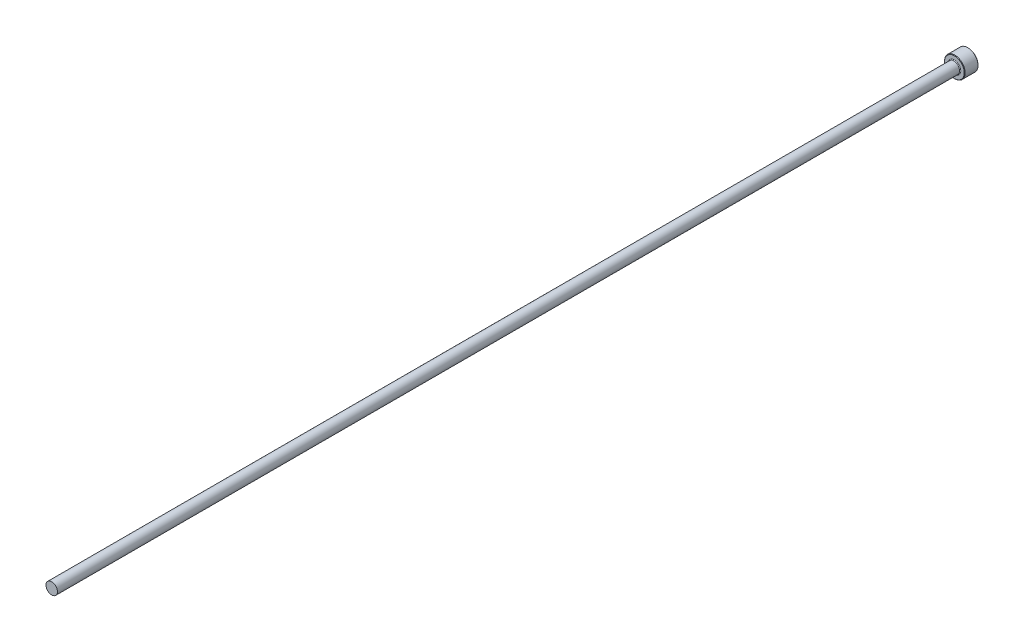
ISO-10303-21;
HEADER;
FILE_DESCRIPTION(('STEP AP214'),'2;1');
FILE_NAME('part.step','',(''),(''),'','','');
FILE_SCHEMA(('AUTOMOTIVE_DESIGN { 1 0 10303 214 1 1 1 1 }'));
ENDSEC;
DATA;
#1=APPLICATION_CONTEXT('core data for automotive mechanical design processes');
#2=APPLICATION_PROTOCOL_DEFINITION('international standard','automotive_design',2000,#1);
#3=PRODUCT_CONTEXT('',#1,'mechanical');
#4=PRODUCT('Part','Part','',(#3));
#5=PRODUCT_RELATED_PRODUCT_CATEGORY('part','',(#4));
#6=PRODUCT_DEFINITION_FORMATION('','',#4);
#7=PRODUCT_DEFINITION_CONTEXT('part definition',#1,'design');
#8=PRODUCT_DEFINITION('design','',#6,#7);
#9=PRODUCT_DEFINITION_SHAPE('','',#8);
#10=(LENGTH_UNIT() NAMED_UNIT(*) SI_UNIT(.MILLI.,.METRE.));
#11=(NAMED_UNIT(*) PLANE_ANGLE_UNIT() SI_UNIT($,.RADIAN.));
#12=(NAMED_UNIT(*) SI_UNIT($,.STERADIAN.) SOLID_ANGLE_UNIT());
#13=UNCERTAINTY_MEASURE_WITH_UNIT(LENGTH_MEASURE(1.E-05),#10,'distance_accuracy_value','');
#14=(GEOMETRIC_REPRESENTATION_CONTEXT(3) GLOBAL_UNCERTAINTY_ASSIGNED_CONTEXT((#13)) GLOBAL_UNIT_ASSIGNED_CONTEXT((#10,
#11,#12)) REPRESENTATION_CONTEXT('',''));
#15=CARTESIAN_POINT('',(0.,0.,0.));
#16=DIRECTION('',(0.,0.,1.));
#17=DIRECTION('',(1.,0.,0.));
#18=AXIS2_PLACEMENT_3D('',#15,#16,#17);
#19=CARTESIAN_POINT('',(0.,2.49999999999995,400.));
#20=DIRECTION('',(0.,0.,-1.));
#21=DIRECTION('',(-1.,0.,0.));
#22=AXIS2_PLACEMENT_3D('',#19,#20,#21);
#23=PLANE('',#22);
#24=CARTESIAN_POINT('',(0.,0.,400.));
#25=DIRECTION('',(0.,0.,1.));
#26=DIRECTION('',(1.,0.,0.));
#27=AXIS2_PLACEMENT_3D('',#24,#25,#26);
#28=CIRCLE('',#27,2.49999999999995);
#29=CARTESIAN_POINT('',(2.49999999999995,0.,400.));
#30=VERTEX_POINT('',#29);
#31=EDGE_CURVE('E50',#30,#30,#28,.T.);
#32=ORIENTED_EDGE('',*,*,#31,.T.);
#33=EDGE_LOOP('',(#32));
#34=FACE_BOUND('',#33,.T.);
#35=ADVANCED_FACE('F30',(#34),#23,.F.);
#36=CARTESIAN_POINT('',(0.,0.,109.050628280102));
#37=DIRECTION('',(0.,0.,1.));
#38=DIRECTION('',(1.,0.,0.));
#39=AXIS2_PLACEMENT_3D('',#36,#37,#38);
#40=CYLINDRICAL_SURFACE('',#39,2.49999999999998);
#41=ORIENTED_EDGE('',*,*,#31,.F.);
#42=EDGE_LOOP('',(#41));
#43=FACE_BOUND('',#42,.T.);
#44=CARTESIAN_POINT('',(0.,0.,6.3));
#45=DIRECTION('',(0.,0.,1.));
#46=DIRECTION('',(1.,0.,0.));
#47=AXIS2_PLACEMENT_3D('',#44,#45,#46);
#48=CIRCLE('',#47,2.5);
#49=CARTESIAN_POINT('',(2.5,0.,6.3));
#50=VERTEX_POINT('',#49);
#51=EDGE_CURVE('E53',#50,#50,#48,.T.);
#52=ORIENTED_EDGE('',*,*,#51,.T.);
#53=EDGE_LOOP('',(#52));
#54=FACE_BOUND('',#53,.T.);
#55=ADVANCED_FACE('F73',(#43,#54),#40,.T.);
#56=CARTESIAN_POINT('',(0.,0.,6.3));
#57=DIRECTION('',(0.,0.,1.));
#58=DIRECTION('',(1.,0.,0.));
#59=AXIS2_PLACEMENT_3D('',#56,#57,#58);
#60=TOROIDAL_SURFACE('',#59,2.8,0.3);
#61=ORIENTED_EDGE('',*,*,#51,.F.);
#62=EDGE_LOOP('',(#61));
#63=FACE_BOUND('',#62,.T.);
#64=CARTESIAN_POINT('',(0.,0.,6.00000000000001));
#65=DIRECTION('',(0.,0.,1.));
#66=DIRECTION('',(1.,0.,0.));
#67=AXIS2_PLACEMENT_3D('',#64,#65,#66);
#68=CIRCLE('',#67,2.8);
#69=CARTESIAN_POINT('',(2.8,0.,6.00000000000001));
#70=VERTEX_POINT('',#69);
#71=EDGE_CURVE('E56',#70,#70,#68,.T.);
#72=ORIENTED_EDGE('',*,*,#71,.T.);
#73=EDGE_LOOP('',(#72));
#74=FACE_BOUND('',#73,.T.);
#75=ADVANCED_FACE('F60',(#63,#74),#60,.F.);
#76=CARTESIAN_POINT('',(0.,4.5,6.));
#77=DIRECTION('',(0.,0.,-1.));
#78=DIRECTION('',(-1.,0.,0.));
#79=AXIS2_PLACEMENT_3D('',#76,#77,#78);
#80=PLANE('',#79);
#81=CARTESIAN_POINT('',(0.,0.,6.));
#82=DIRECTION('',(0.,0.,-1.));
#83=DIRECTION('',(-1.,0.,0.));
#84=AXIS2_PLACEMENT_3D('',#81,#82,#83);
#85=CIRCLE('',#84,4.30000000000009);
#86=CARTESIAN_POINT('',(-4.30000000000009,0.,6.));
#87=VERTEX_POINT('',#86);
#88=EDGE_CURVE('E10',#87,#87,#85,.F.);
#89=ORIENTED_EDGE('',*,*,#88,.T.);
#90=EDGE_LOOP('',(#89));
#91=FACE_BOUND('',#90,.T.);
#92=ORIENTED_EDGE('',*,*,#71,.F.);
#93=EDGE_LOOP('',(#92));
#94=FACE_BOUND('',#93,.T.);
#95=ADVANCED_FACE('F62',(#91,#94),#80,.F.);
#96=CARTESIAN_POINT('',(0.,0.,109.050628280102));
#97=DIRECTION('',(0.,0.,1.));
#98=DIRECTION('',(1.,0.,0.));
#99=AXIS2_PLACEMENT_3D('',#96,#97,#98);
#100=CYLINDRICAL_SURFACE('',#99,4.5);
#101=CARTESIAN_POINT('',(0.,0.,0.200000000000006));
#102=DIRECTION('',(0.,0.,1.));
#103=DIRECTION('',(1.,0.,0.));
#104=AXIS2_PLACEMENT_3D('',#101,#102,#103);
#105=CIRCLE('',#104,4.5);
#106=CARTESIAN_POINT('',(4.5,0.,0.200000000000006));
#107=VERTEX_POINT('',#106);
#108=EDGE_CURVE('E41',#107,#107,#105,.T.);
#109=ORIENTED_EDGE('',*,*,#108,.T.);
#110=EDGE_LOOP('',(#109));
#111=FACE_BOUND('',#110,.T.);
#112=CARTESIAN_POINT('',(0.,0.,5.80000000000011));
#113=DIRECTION('',(0.,0.,-1.));
#114=DIRECTION('',(-1.,0.,0.));
#115=AXIS2_PLACEMENT_3D('',#112,#113,#114);
#116=CIRCLE('',#115,4.5);
#117=CARTESIAN_POINT('',(-4.5,0.,5.80000000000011));
#118=VERTEX_POINT('',#117);
#119=EDGE_CURVE('E45',#118,#118,#116,.T.);
#120=ORIENTED_EDGE('',*,*,#119,.T.);
#121=EDGE_LOOP('',(#120));
#122=FACE_BOUND('',#121,.T.);
#123=ADVANCED_FACE('F64',(#111,#122),#100,.T.);
#124=CARTESIAN_POINT('',(0.,0.,0.));
#125=DIRECTION('',(0.,0.,1.));
#126=DIRECTION('',(1.,0.,0.));
#127=AXIS2_PLACEMENT_3D('',#124,#125,#126);
#128=PLANE('',#127);
#129=CARTESIAN_POINT('',(0.,0.,0.));
#130=DIRECTION('',(0.,0.,1.));
#131=DIRECTION('',(1.,0.,0.));
#132=AXIS2_PLACEMENT_3D('',#129,#130,#131);
#133=CIRCLE('',#132,4.29999999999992);
#134=CARTESIAN_POINT('',(4.29999999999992,0.,0.));
#135=VERTEX_POINT('',#134);
#136=EDGE_CURVE('E37',#135,#135,#133,.F.);
#137=ORIENTED_EDGE('',*,*,#136,.T.);
#138=EDGE_LOOP('',(#137));
#139=FACE_BOUND('',#138,.T.);
#140=ADVANCED_FACE('F70',(#139),#128,.F.);
#141=CARTESIAN_POINT('',(0.,0.,0.200000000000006));
#142=DIRECTION('',(0.,0.,1.));
#143=DIRECTION('',(1.,0.,0.));
#144=AXIS2_PLACEMENT_3D('',#141,#142,#143);
#145=CONICAL_SURFACE('',#144,4.5,0.785398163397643);
#146=ORIENTED_EDGE('',*,*,#136,.F.);
#147=EDGE_LOOP('',(#146));
#148=FACE_BOUND('',#147,.T.);
#149=ORIENTED_EDGE('',*,*,#108,.F.);
#150=EDGE_LOOP('',(#149));
#151=FACE_BOUND('',#150,.T.);
#152=ADVANCED_FACE('F84',(#148,#151),#145,.T.);
#153=CARTESIAN_POINT('',(0.,0.,6.00000000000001));
#154=DIRECTION('',(0.,0.,-1.));
#155=DIRECTION('',(-1.,0.,0.));
#156=AXIS2_PLACEMENT_3D('',#153,#154,#155);
#157=CONICAL_SURFACE('',#156,4.30000000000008,0.785398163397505);
#158=ORIENTED_EDGE('',*,*,#119,.F.);
#159=EDGE_LOOP('',(#158));
#160=FACE_BOUND('',#159,.T.);
#161=ORIENTED_EDGE('',*,*,#88,.F.);
#162=EDGE_LOOP('',(#161));
#163=FACE_BOUND('',#162,.T.);
#164=ADVANCED_FACE('F32',(#160,#163),#157,.T.);
#165=CLOSED_SHELL('',(#35,#55,#75,#95,#123,#140,#152,#164));
#166=MANIFOLD_SOLID_BREP('B2',#165);
#167=ADVANCED_BREP_SHAPE_REPRESENTATION('',(#18,#166),#14);
#168=SHAPE_DEFINITION_REPRESENTATION(#9,#167);
ENDSEC;
END-ISO-10303-21;
